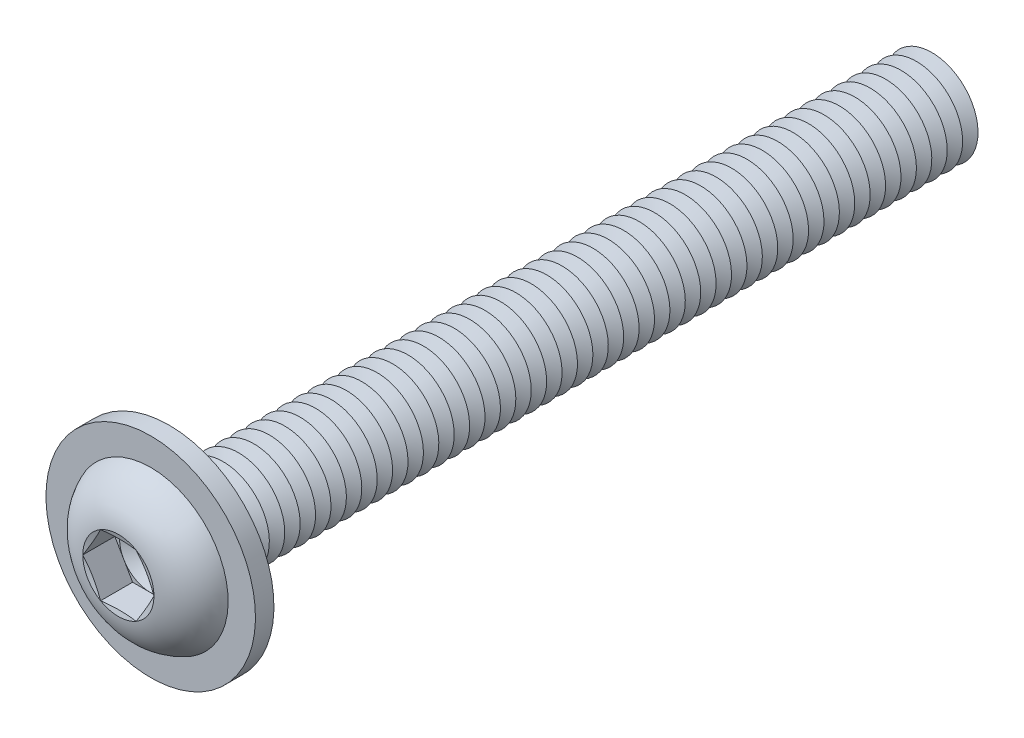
from build123d import *

# Parameters (mm, degrees)
FILLET1_R           = 0.5
LPATTERN1_COUNT     = 50
LPATTERN1_PITCH     = 1
CUT_EXTRUDE1_DEPTH  = 2.08
SKETCH5_R           = 6.8
SKETCH5_R_2         = 3.5
BOSS_EXTRUDE1_DEPTH = 1.2


with BuildPart() as part:
    # Sketch1 → Revolve1 (revolve)
    with BuildSketch(Plane(origin=(0, 0, 0), x_dir=(0, 0, -1), z_dir=(1, 0, 0))):
        with BuildLine():
            Line((0, 3), (0, 5.25))
            ThreePointArc((0, 5.25), (-2.210041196, 4.408189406), (-3.3, 2.3094))
            Line((-3.3, 2.3094), (-2.990599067, 1.1547))
            Line((-2.990599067, 1.1547), (-3.3, 1.1547))
            Line((-3.3, 1.1547), (-3.3, 0))
            Line((-3.3, 0), (50, 0))
            Line((50, 0), (50, 3))
            Line((50, 3), (0, 3))
        make_face()
    revolve(axis=Axis((0, 0, -50), (0, 0, 1)))

    # Fillet1
    fillet1_edges = [part.edges().sort_by_distance(p)[0] for p in [
        (0, -3, 0),
    ]]
    fillet(fillet1_edges, radius=FILLET1_R)

    # Sketch2 → Cut-Revolve1 (revolve, cut)
    with BuildSketch(Plane(origin=(0, 0, 0), x_dir=(0, 0, -1), z_dir=(1, 0, 0))):
        Polygon((49.5, 3), (50.5, 3), (50, 2.133974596), align=None)
    cut_revolve1 = revolve(axis=Axis((0, 0, -50), (0, 0, -1)), mode=Mode.SUBTRACT)

    # LPattern1: Cut-Revolve1 ×50
    with Locations(*[(0, 0, i * LPATTERN1_PITCH) for i in range(1, LPATTERN1_COUNT)]):
        add(cut_revolve1, mode=Mode.SUBTRACT)

    # Sketch3 → Cut-Extrude1 (cut)
    with BuildSketch(Plane.XY.offset(3.3)):
        Polygon((1.1547, 1.999999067), (-1.1547, 1.999999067), (-2.3094, 0), (-1.1547, -1.999999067), (1.1547, -1.999999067), (2.3094, 0), align=None)
    extrude(amount=-CUT_EXTRUDE1_DEPTH, mode=Mode.SUBTRACT)

    # Cut-Extrude2 cone 1 section (on through the dimple's axis) → Cut-Extrude2 (revolve, cut)
    with BuildSketch(Plane(origin=(0, 0, 1.22), x_dir=(0, -1, 0), z_dir=(1, 0, 0))):
        Polygon((0, 0), (1.999999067, 0), (0, 1.1547), align=None)
    revolve(axis=Axis((0, 0, 1.22), (0, 0, -1)), mode=Mode.SUBTRACT)

    # Sketch5 → Boss-Extrude1 (add)
    with BuildSketch(Plane(origin=(0, 0, 0), x_dir=(-1, 0, 0), z_dir=(0, 0, -1))):
        with Locations(Location((0, 0, 0), (0, 0, 90))):
            Circle(SKETCH5_R)
        Circle(SKETCH5_R_2, mode=Mode.SUBTRACT)
    extrude(amount=-BOSS_EXTRUDE1_DEPTH)


solid = part.part
